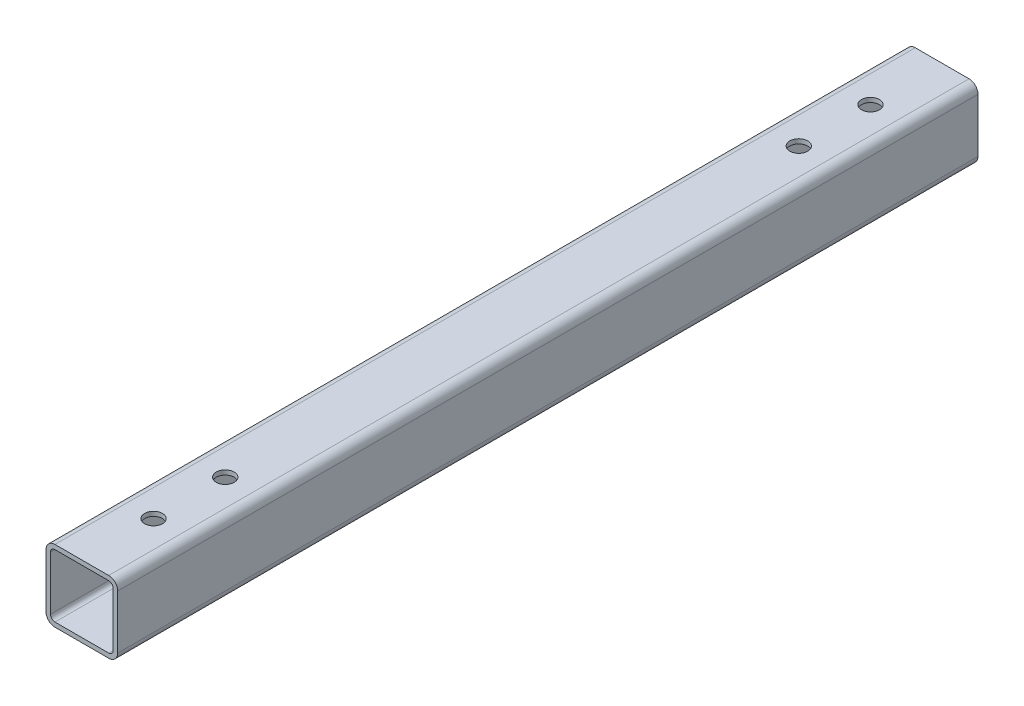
ISO-10303-21;
HEADER;
FILE_DESCRIPTION(('STEP AP214'),'2;1');
FILE_NAME('part.step','',(''),(''),'','','');
FILE_SCHEMA(('AUTOMOTIVE_DESIGN { 1 0 10303 214 1 1 1 1 }'));
ENDSEC;
DATA;
#1=APPLICATION_CONTEXT('core data for automotive mechanical design processes');
#2=APPLICATION_PROTOCOL_DEFINITION('international standard','automotive_design',2000,#1);
#3=PRODUCT_CONTEXT('',#1,'mechanical');
#4=PRODUCT('Part','Part','',(#3));
#5=PRODUCT_RELATED_PRODUCT_CATEGORY('part','',(#4));
#6=PRODUCT_DEFINITION_FORMATION('','',#4);
#7=PRODUCT_DEFINITION_CONTEXT('part definition',#1,'design');
#8=PRODUCT_DEFINITION('design','',#6,#7);
#9=PRODUCT_DEFINITION_SHAPE('','',#8);
#10=(LENGTH_UNIT() NAMED_UNIT(*) SI_UNIT(.MILLI.,.METRE.));
#11=(NAMED_UNIT(*) PLANE_ANGLE_UNIT() SI_UNIT($,.RADIAN.));
#12=(NAMED_UNIT(*) SI_UNIT($,.STERADIAN.) SOLID_ANGLE_UNIT());
#13=UNCERTAINTY_MEASURE_WITH_UNIT(LENGTH_MEASURE(1.E-05),#10,'distance_accuracy_value','');
#14=(GEOMETRIC_REPRESENTATION_CONTEXT(3) GLOBAL_UNCERTAINTY_ASSIGNED_CONTEXT((#13)) GLOBAL_UNIT_ASSIGNED_CONTEXT((#10,
#11,#12)) REPRESENTATION_CONTEXT('',''));
#15=CARTESIAN_POINT('',(0.,0.,0.));
#16=DIRECTION('',(0.,0.,1.));
#17=DIRECTION('',(1.,0.,0.));
#18=AXIS2_PLACEMENT_3D('',#15,#16,#17);
#19=CARTESIAN_POINT('',(-12.7,-12.7,-152.4));
#20=DIRECTION('',(0.,0.,-1.));
#21=DIRECTION('',(-1.,0.,0.));
#22=AXIS2_PLACEMENT_3D('',#19,#20,#21);
#23=PLANE('',#22);
#24=DIRECTION('',(0.,-1.,0.));
#25=VECTOR('',#24,1.);
#26=CARTESIAN_POINT('',(-12.7,12.7,-152.4));
#27=LINE('',#26,#25);
#28=CARTESIAN_POINT('',(-12.7,9.525,-152.4));
#29=VERTEX_POINT('',#28);
#30=CARTESIAN_POINT('',(-12.7,-9.525,-152.4));
#31=VERTEX_POINT('',#30);
#32=EDGE_CURVE('E237',#29,#31,#27,.T.);
#33=ORIENTED_EDGE('',*,*,#32,.F.);
#34=CARTESIAN_POINT('',(-9.525,9.525,-152.4));
#35=DIRECTION('',(0.,0.,-1.));
#36=DIRECTION('',(-1.,0.,0.));
#37=AXIS2_PLACEMENT_3D('',#34,#35,#36);
#38=CIRCLE('',#37,3.175);
#39=CARTESIAN_POINT('',(-9.525,12.7,-152.4));
#40=VERTEX_POINT('',#39);
#41=EDGE_CURVE('E261',#29,#40,#38,.T.);
#42=ORIENTED_EDGE('',*,*,#41,.T.);
#43=DIRECTION('',(1.,0.,0.));
#44=VECTOR('',#43,1.);
#45=CARTESIAN_POINT('',(-12.7,12.7,-152.4));
#46=LINE('',#45,#44);
#47=CARTESIAN_POINT('',(9.525,12.7,-152.4));
#48=VERTEX_POINT('',#47);
#49=EDGE_CURVE('E228',#40,#48,#46,.T.);
#50=ORIENTED_EDGE('',*,*,#49,.T.);
#51=CARTESIAN_POINT('',(9.525,9.525,-152.4));
#52=DIRECTION('',(0.,0.,-1.));
#53=DIRECTION('',(-1.,0.,0.));
#54=AXIS2_PLACEMENT_3D('',#51,#52,#53);
#55=CIRCLE('',#54,3.175);
#56=CARTESIAN_POINT('',(12.7,9.525,-152.4));
#57=VERTEX_POINT('',#56);
#58=EDGE_CURVE('E263',#48,#57,#55,.T.);
#59=ORIENTED_EDGE('',*,*,#58,.T.);
#60=DIRECTION('',(0.,1.,0.));
#61=VECTOR('',#60,1.);
#62=CARTESIAN_POINT('',(12.7,-12.7,-152.4));
#63=LINE('',#62,#61);
#64=CARTESIAN_POINT('',(12.7,-9.525,-152.4));
#65=VERTEX_POINT('',#64);
#66=EDGE_CURVE('E250',#65,#57,#63,.T.);
#67=ORIENTED_EDGE('',*,*,#66,.F.);
#68=CARTESIAN_POINT('',(9.525,-9.525,-152.4));
#69=DIRECTION('',(0.,0.,-1.));
#70=DIRECTION('',(-1.,0.,0.));
#71=AXIS2_PLACEMENT_3D('',#68,#69,#70);
#72=CIRCLE('',#71,3.175);
#73=CARTESIAN_POINT('',(9.525,-12.7,-152.4));
#74=VERTEX_POINT('',#73);
#75=EDGE_CURVE('E256',#65,#74,#72,.T.);
#76=ORIENTED_EDGE('',*,*,#75,.T.);
#77=DIRECTION('',(-1.,0.,0.));
#78=VECTOR('',#77,1.);
#79=CARTESIAN_POINT('',(12.7,-12.7,-152.4));
#80=LINE('',#79,#78);
#81=CARTESIAN_POINT('',(-9.52499999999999,-12.7,-152.4));
#82=VERTEX_POINT('',#81);
#83=EDGE_CURVE('E243',#74,#82,#80,.T.);
#84=ORIENTED_EDGE('',*,*,#83,.T.);
#85=CARTESIAN_POINT('',(-9.52499999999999,-9.525,-152.4));
#86=DIRECTION('',(0.,0.,-1.));
#87=DIRECTION('',(-1.,0.,0.));
#88=AXIS2_PLACEMENT_3D('',#85,#86,#87);
#89=CIRCLE('',#88,3.175);
#90=EDGE_CURVE('E262',#82,#31,#89,.T.);
#91=ORIENTED_EDGE('',*,*,#90,.T.);
#92=EDGE_LOOP('',(#33,#42,#50,#59,#67,#76,#84,#91));
#93=FACE_BOUND('',#92,.T.);
#94=CARTESIAN_POINT('',(-9.525,9.525,-152.4));
#95=DIRECTION('',(0.,0.,-1.));
#96=DIRECTION('',(-1.,0.,0.));
#97=AXIS2_PLACEMENT_3D('',#94,#95,#96);
#98=CIRCLE('',#97,1.5875);
#99=CARTESIAN_POINT('',(-11.1125,9.525,-152.4));
#100=VERTEX_POINT('',#99);
#101=CARTESIAN_POINT('',(-9.525,11.1125,-152.4));
#102=VERTEX_POINT('',#101);
#103=EDGE_CURVE('E210',#100,#102,#98,.T.);
#104=ORIENTED_EDGE('',*,*,#103,.F.);
#105=DIRECTION('',(0.,-1.,0.));
#106=VECTOR('',#105,1.);
#107=CARTESIAN_POINT('',(-11.1125,-12.7,-152.4));
#108=LINE('',#107,#106);
#109=CARTESIAN_POINT('',(-11.1125,-9.525,-152.4));
#110=VERTEX_POINT('',#109);
#111=EDGE_CURVE('E204',#100,#110,#108,.T.);
#112=ORIENTED_EDGE('',*,*,#111,.T.);
#113=CARTESIAN_POINT('',(-9.52499999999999,-9.525,-152.4));
#114=DIRECTION('',(0.,0.,-1.));
#115=DIRECTION('',(-1.,0.,0.));
#116=AXIS2_PLACEMENT_3D('',#113,#114,#115);
#117=CIRCLE('',#116,1.5875);
#118=CARTESIAN_POINT('',(-9.52499999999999,-11.1125,-152.4));
#119=VERTEX_POINT('',#118);
#120=EDGE_CURVE('E164',#119,#110,#117,.T.);
#121=ORIENTED_EDGE('',*,*,#120,.F.);
#122=DIRECTION('',(-1.,0.,0.));
#123=VECTOR('',#122,1.);
#124=CARTESIAN_POINT('',(-12.7,-11.1125,-152.4));
#125=LINE('',#124,#123);
#126=CARTESIAN_POINT('',(9.525,-11.1125,-152.4));
#127=VERTEX_POINT('',#126);
#128=EDGE_CURVE('E69',#127,#119,#125,.T.);
#129=ORIENTED_EDGE('',*,*,#128,.F.);
#130=CARTESIAN_POINT('',(9.525,-9.525,-152.4));
#131=DIRECTION('',(0.,0.,-1.));
#132=DIRECTION('',(-1.,0.,0.));
#133=AXIS2_PLACEMENT_3D('',#130,#131,#132);
#134=CIRCLE('',#133,1.5875);
#135=CARTESIAN_POINT('',(11.1125,-9.525,-152.4));
#136=VERTEX_POINT('',#135);
#137=EDGE_CURVE('E213',#136,#127,#134,.T.);
#138=ORIENTED_EDGE('',*,*,#137,.F.);
#139=DIRECTION('',(0.,1.,0.));
#140=VECTOR('',#139,1.);
#141=CARTESIAN_POINT('',(11.1125,-12.7,-152.4));
#142=LINE('',#141,#140);
#143=CARTESIAN_POINT('',(11.1125,9.52499999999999,-152.4));
#144=VERTEX_POINT('',#143);
#145=EDGE_CURVE('E215',#136,#144,#142,.T.);
#146=ORIENTED_EDGE('',*,*,#145,.T.);
#147=CARTESIAN_POINT('',(9.525,9.525,-152.4));
#148=DIRECTION('',(0.,0.,-1.));
#149=DIRECTION('',(-1.,0.,0.));
#150=AXIS2_PLACEMENT_3D('',#147,#148,#149);
#151=CIRCLE('',#150,1.5875);
#152=CARTESIAN_POINT('',(9.525,11.1125,-152.4));
#153=VERTEX_POINT('',#152);
#154=EDGE_CURVE('E214',#153,#144,#151,.T.);
#155=ORIENTED_EDGE('',*,*,#154,.F.);
#156=DIRECTION('',(1.,0.,0.));
#157=VECTOR('',#156,1.);
#158=CARTESIAN_POINT('',(-12.7,11.1125,-152.4));
#159=LINE('',#158,#157);
#160=EDGE_CURVE('E179',#102,#153,#159,.T.);
#161=ORIENTED_EDGE('',*,*,#160,.F.);
#162=EDGE_LOOP('',(#104,#112,#121,#129,#138,#146,#155,#161));
#163=FACE_BOUND('',#162,.T.);
#164=ADVANCED_FACE('F41',(#93,#163),#23,.T.);
#165=CARTESIAN_POINT('',(-12.7,12.7,152.4));
#166=DIRECTION('',(1.,0.,0.));
#167=DIRECTION('',(0.,1.,0.));
#168=AXIS2_PLACEMENT_3D('',#165,#166,#167);
#169=PLANE('',#168);
#170=DIRECTION('',(0.,-1.,0.));
#171=VECTOR('',#170,1.);
#172=CARTESIAN_POINT('',(-12.7,12.7,152.4));
#173=LINE('',#172,#171);
#174=CARTESIAN_POINT('',(-12.7,9.525,152.4));
#175=VERTEX_POINT('',#174);
#176=CARTESIAN_POINT('',(-12.7,-9.525,152.4));
#177=VERTEX_POINT('',#176);
#178=EDGE_CURVE('E225',#175,#177,#173,.T.);
#179=ORIENTED_EDGE('',*,*,#178,.F.);
#180=DIRECTION('',(0.,0.,-1.));
#181=VECTOR('',#180,1.);
#182=CARTESIAN_POINT('',(-12.7,9.525,-152.4));
#183=LINE('',#182,#181);
#184=EDGE_CURVE('E253',#175,#29,#183,.T.);
#185=ORIENTED_EDGE('',*,*,#184,.T.);
#186=ORIENTED_EDGE('',*,*,#32,.T.);
#187=DIRECTION('',(0.,0.,-1.));
#188=VECTOR('',#187,1.);
#189=CARTESIAN_POINT('',(-12.7,-9.525,152.4));
#190=LINE('',#189,#188);
#191=EDGE_CURVE('E238',#31,#177,#190,.F.);
#192=ORIENTED_EDGE('',*,*,#191,.T.);
#193=EDGE_LOOP('',(#179,#185,#186,#192));
#194=FACE_BOUND('',#193,.T.);
#195=ADVANCED_FACE('F384',(#194),#169,.F.);
#196=CARTESIAN_POINT('',(12.7,-12.7,152.4));
#197=DIRECTION('',(0.,-1.,0.));
#198=DIRECTION('',(1.,0.,0.));
#199=AXIS2_PLACEMENT_3D('',#196,#197,#198);
#200=PLANE('',#199);
#201=CARTESIAN_POINT('',(0.,-12.7,-101.6));
#202=DIRECTION('',(0.,-1.,0.));
#203=DIRECTION('',(1.,0.,0.));
#204=AXIS2_PLACEMENT_3D('',#201,#202,#203);
#205=CIRCLE('',#204,3.17499999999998);
#206=CARTESIAN_POINT('',(3.17499999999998,-12.7,-101.6));
#207=VERTEX_POINT('',#206);
#208=EDGE_CURVE('E581',#207,#207,#205,.T.);
#209=ORIENTED_EDGE('',*,*,#208,.F.);
#210=EDGE_LOOP('',(#209));
#211=FACE_BOUND('',#210,.T.);
#212=CARTESIAN_POINT('',(0.,-12.7,-127.));
#213=DIRECTION('',(0.,-1.,0.));
#214=DIRECTION('',(1.,0.,0.));
#215=AXIS2_PLACEMENT_3D('',#212,#213,#214);
#216=CIRCLE('',#215,3.17499999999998);
#217=CARTESIAN_POINT('',(3.17499999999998,-12.7,-127.));
#218=VERTEX_POINT('',#217);
#219=EDGE_CURVE('E309',#218,#218,#216,.T.);
#220=ORIENTED_EDGE('',*,*,#219,.F.);
#221=EDGE_LOOP('',(#220));
#222=FACE_BOUND('',#221,.T.);
#223=CARTESIAN_POINT('',(0.,-12.7,101.6));
#224=DIRECTION('',(0.,-1.,0.));
#225=DIRECTION('',(1.,0.,0.));
#226=AXIS2_PLACEMENT_3D('',#223,#224,#225);
#227=CIRCLE('',#226,3.17499999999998);
#228=CARTESIAN_POINT('',(3.17499999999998,-12.7,101.6));
#229=VERTEX_POINT('',#228);
#230=EDGE_CURVE('E310',#229,#229,#227,.T.);
#231=ORIENTED_EDGE('',*,*,#230,.F.);
#232=EDGE_LOOP('',(#231));
#233=FACE_BOUND('',#232,.T.);
#234=CARTESIAN_POINT('',(0.,-12.7,127.));
#235=DIRECTION('',(0.,-1.,0.));
#236=DIRECTION('',(1.,0.,0.));
#237=AXIS2_PLACEMENT_3D('',#234,#235,#236);
#238=CIRCLE('',#237,3.17499999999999);
#239=CARTESIAN_POINT('',(3.17499999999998,-12.7,127.));
#240=VERTEX_POINT('',#239);
#241=EDGE_CURVE('E328',#240,#240,#238,.T.);
#242=ORIENTED_EDGE('',*,*,#241,.F.);
#243=EDGE_LOOP('',(#242));
#244=FACE_BOUND('',#243,.T.);
#245=DIRECTION('',(-1.,0.,0.));
#246=VECTOR('',#245,1.);
#247=CARTESIAN_POINT('',(12.7,-12.7,152.4));
#248=LINE('',#247,#246);
#249=CARTESIAN_POINT('',(9.525,-12.7,152.4));
#250=VERTEX_POINT('',#249);
#251=CARTESIAN_POINT('',(-9.52499999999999,-12.7,152.4));
#252=VERTEX_POINT('',#251);
#253=EDGE_CURVE('E224',#250,#252,#248,.T.);
#254=ORIENTED_EDGE('',*,*,#253,.T.);
#255=DIRECTION('',(0.,0.,-1.));
#256=VECTOR('',#255,1.);
#257=CARTESIAN_POINT('',(-9.52499999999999,-12.7,-152.4));
#258=LINE('',#257,#256);
#259=EDGE_CURVE('E284',#252,#82,#258,.T.);
#260=ORIENTED_EDGE('',*,*,#259,.T.);
#261=ORIENTED_EDGE('',*,*,#83,.F.);
#262=DIRECTION('',(0.,0.,-1.));
#263=VECTOR('',#262,1.);
#264=CARTESIAN_POINT('',(9.525,-12.7,152.4));
#265=LINE('',#264,#263);
#266=EDGE_CURVE('E285',#74,#250,#265,.F.);
#267=ORIENTED_EDGE('',*,*,#266,.T.);
#268=EDGE_LOOP('',(#254,#260,#261,#267));
#269=FACE_BOUND('',#268,.T.);
#270=ADVANCED_FACE('F386',(#211,#222,#233,#244,#269),#200,.T.);
#271=CARTESIAN_POINT('',(12.7,-12.7,152.4));
#272=DIRECTION('',(-1.,0.,0.));
#273=DIRECTION('',(0.,0.,1.));
#274=AXIS2_PLACEMENT_3D('',#271,#272,#273);
#275=PLANE('',#274);
#276=ORIENTED_EDGE('',*,*,#66,.T.);
#277=DIRECTION('',(0.,0.,-1.));
#278=VECTOR('',#277,1.);
#279=CARTESIAN_POINT('',(12.7,9.525,152.4));
#280=LINE('',#279,#278);
#281=CARTESIAN_POINT('',(12.7,9.525,152.4));
#282=VERTEX_POINT('',#281);
#283=EDGE_CURVE('E11',#57,#282,#280,.F.);
#284=ORIENTED_EDGE('',*,*,#283,.T.);
#285=DIRECTION('',(0.,1.,0.));
#286=VECTOR('',#285,1.);
#287=CARTESIAN_POINT('',(12.7,-12.7,152.4));
#288=LINE('',#287,#286);
#289=CARTESIAN_POINT('',(12.7,-9.525,152.4));
#290=VERTEX_POINT('',#289);
#291=EDGE_CURVE('E229',#290,#282,#288,.T.);
#292=ORIENTED_EDGE('',*,*,#291,.F.);
#293=DIRECTION('',(0.,0.,-1.));
#294=VECTOR('',#293,1.);
#295=CARTESIAN_POINT('',(12.7,-9.525,-152.4));
#296=LINE('',#295,#294);
#297=EDGE_CURVE('E51',#290,#65,#296,.T.);
#298=ORIENTED_EDGE('',*,*,#297,.T.);
#299=EDGE_LOOP('',(#276,#284,#292,#298));
#300=FACE_BOUND('',#299,.T.);
#301=ADVANCED_FACE('F396',(#300),#275,.F.);
#302=CARTESIAN_POINT('',(-12.7,12.7,152.4));
#303=DIRECTION('',(0.,1.,0.));
#304=DIRECTION('',(-1.,0.,0.));
#305=AXIS2_PLACEMENT_3D('',#302,#303,#304);
#306=PLANE('',#305);
#307=CARTESIAN_POINT('',(0.,12.7,-101.6));
#308=DIRECTION('',(0.,-1.,0.));
#309=DIRECTION('',(1.,0.,0.));
#310=AXIS2_PLACEMENT_3D('',#307,#308,#309);
#311=CIRCLE('',#310,3.17499999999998);
#312=CARTESIAN_POINT('',(3.17499999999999,12.7,-101.6));
#313=VERTEX_POINT('',#312);
#314=EDGE_CURVE('E589',#313,#313,#311,.T.);
#315=ORIENTED_EDGE('',*,*,#314,.T.);
#316=EDGE_LOOP('',(#315));
#317=FACE_BOUND('',#316,.T.);
#318=CARTESIAN_POINT('',(0.,12.7,-127.));
#319=DIRECTION('',(0.,-1.,0.));
#320=DIRECTION('',(1.,0.,0.));
#321=AXIS2_PLACEMENT_3D('',#318,#319,#320);
#322=CIRCLE('',#321,3.17499999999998);
#323=CARTESIAN_POINT('',(3.17499999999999,12.7,-127.));
#324=VERTEX_POINT('',#323);
#325=EDGE_CURVE('E303',#324,#324,#322,.T.);
#326=ORIENTED_EDGE('',*,*,#325,.T.);
#327=EDGE_LOOP('',(#326));
#328=FACE_BOUND('',#327,.T.);
#329=CARTESIAN_POINT('',(0.,12.7,101.6));
#330=DIRECTION('',(0.,-1.,0.));
#331=DIRECTION('',(1.,0.,0.));
#332=AXIS2_PLACEMENT_3D('',#329,#330,#331);
#333=CIRCLE('',#332,3.17499999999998);
#334=CARTESIAN_POINT('',(3.17499999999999,12.7,101.6));
#335=VERTEX_POINT('',#334);
#336=EDGE_CURVE('E299',#335,#335,#333,.T.);
#337=ORIENTED_EDGE('',*,*,#336,.T.);
#338=EDGE_LOOP('',(#337));
#339=FACE_BOUND('',#338,.T.);
#340=CARTESIAN_POINT('',(0.,12.7,127.));
#341=DIRECTION('',(0.,-1.,0.));
#342=DIRECTION('',(1.,0.,0.));
#343=AXIS2_PLACEMENT_3D('',#340,#341,#342);
#344=CIRCLE('',#343,3.17499999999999);
#345=CARTESIAN_POINT('',(3.17499999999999,12.7,127.));
#346=VERTEX_POINT('',#345);
#347=EDGE_CURVE('E294',#346,#346,#344,.T.);
#348=ORIENTED_EDGE('',*,*,#347,.T.);
#349=EDGE_LOOP('',(#348));
#350=FACE_BOUND('',#349,.T.);
#351=ORIENTED_EDGE('',*,*,#49,.F.);
#352=DIRECTION('',(0.,0.,-1.));
#353=VECTOR('',#352,1.);
#354=CARTESIAN_POINT('',(-9.525,12.7,152.4));
#355=LINE('',#354,#353);
#356=CARTESIAN_POINT('',(-9.525,12.7,152.4));
#357=VERTEX_POINT('',#356);
#358=EDGE_CURVE('E272',#40,#357,#355,.F.);
#359=ORIENTED_EDGE('',*,*,#358,.T.);
#360=DIRECTION('',(1.,0.,0.));
#361=VECTOR('',#360,1.);
#362=CARTESIAN_POINT('',(-12.7,12.7,152.4));
#363=LINE('',#362,#361);
#364=CARTESIAN_POINT('',(9.525,12.7,152.4));
#365=VERTEX_POINT('',#364);
#366=EDGE_CURVE('E234',#357,#365,#363,.T.);
#367=ORIENTED_EDGE('',*,*,#366,.T.);
#368=DIRECTION('',(0.,0.,-1.));
#369=VECTOR('',#368,1.);
#370=CARTESIAN_POINT('',(9.525,12.7,-152.4));
#371=LINE('',#370,#369);
#372=EDGE_CURVE('E270',#365,#48,#371,.T.);
#373=ORIENTED_EDGE('',*,*,#372,.T.);
#374=EDGE_LOOP('',(#351,#359,#367,#373));
#375=FACE_BOUND('',#374,.T.);
#376=ADVANCED_FACE('F398',(#317,#328,#339,#350,#375),#306,.T.);
#377=CARTESIAN_POINT('',(-12.7,-12.7,152.4));
#378=DIRECTION('',(0.,0.,-1.));
#379=DIRECTION('',(-1.,0.,0.));
#380=AXIS2_PLACEMENT_3D('',#377,#378,#379);
#381=PLANE('',#380);
#382=CARTESIAN_POINT('',(-9.525,9.525,152.4));
#383=DIRECTION('',(0.,0.,-1.));
#384=DIRECTION('',(-1.,0.,0.));
#385=AXIS2_PLACEMENT_3D('',#382,#383,#384);
#386=CIRCLE('',#385,1.5875);
#387=CARTESIAN_POINT('',(-9.525,11.1125,152.4));
#388=VERTEX_POINT('',#387);
#389=CARTESIAN_POINT('',(-11.1125,9.525,152.4));
#390=VERTEX_POINT('',#389);
#391=EDGE_CURVE('E190',#388,#390,#386,.F.);
#392=ORIENTED_EDGE('',*,*,#391,.F.);
#393=DIRECTION('',(1.,0.,0.));
#394=VECTOR('',#393,1.);
#395=CARTESIAN_POINT('',(-12.7,11.1125,152.4));
#396=LINE('',#395,#394);
#397=CARTESIAN_POINT('',(9.525,11.1125,152.4));
#398=VERTEX_POINT('',#397);
#399=EDGE_CURVE('E171',#388,#398,#396,.T.);
#400=ORIENTED_EDGE('',*,*,#399,.T.);
#401=CARTESIAN_POINT('',(9.525,9.525,152.4));
#402=DIRECTION('',(0.,0.,-1.));
#403=DIRECTION('',(-1.,0.,0.));
#404=AXIS2_PLACEMENT_3D('',#401,#402,#403);
#405=CIRCLE('',#404,1.5875);
#406=CARTESIAN_POINT('',(11.1125,9.52499999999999,152.4));
#407=VERTEX_POINT('',#406);
#408=EDGE_CURVE('E189',#407,#398,#405,.F.);
#409=ORIENTED_EDGE('',*,*,#408,.F.);
#410=DIRECTION('',(0.,1.,0.));
#411=VECTOR('',#410,1.);
#412=CARTESIAN_POINT('',(11.1125,-12.7,152.4));
#413=LINE('',#412,#411);
#414=CARTESIAN_POINT('',(11.1125,-9.525,152.4));
#415=VERTEX_POINT('',#414);
#416=EDGE_CURVE('E56',#415,#407,#413,.T.);
#417=ORIENTED_EDGE('',*,*,#416,.F.);
#418=CARTESIAN_POINT('',(9.525,-9.525,152.4));
#419=DIRECTION('',(0.,0.,-1.));
#420=DIRECTION('',(-1.,0.,0.));
#421=AXIS2_PLACEMENT_3D('',#418,#419,#420);
#422=CIRCLE('',#421,1.5875);
#423=CARTESIAN_POINT('',(9.525,-11.1125,152.4));
#424=VERTEX_POINT('',#423);
#425=EDGE_CURVE('E195',#424,#415,#422,.F.);
#426=ORIENTED_EDGE('',*,*,#425,.F.);
#427=DIRECTION('',(-1.,0.,0.));
#428=VECTOR('',#427,1.);
#429=CARTESIAN_POINT('',(-12.7,-11.1125,152.4));
#430=LINE('',#429,#428);
#431=CARTESIAN_POINT('',(-9.52499999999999,-11.1125,152.4));
#432=VERTEX_POINT('',#431);
#433=EDGE_CURVE('E177',#424,#432,#430,.T.);
#434=ORIENTED_EDGE('',*,*,#433,.T.);
#435=CARTESIAN_POINT('',(-9.52499999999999,-9.525,152.4));
#436=DIRECTION('',(0.,0.,-1.));
#437=DIRECTION('',(-1.,0.,0.));
#438=AXIS2_PLACEMENT_3D('',#435,#436,#437);
#439=CIRCLE('',#438,1.5875);
#440=CARTESIAN_POINT('',(-11.1125,-9.525,152.4));
#441=VERTEX_POINT('',#440);
#442=EDGE_CURVE('E161',#441,#432,#439,.F.);
#443=ORIENTED_EDGE('',*,*,#442,.F.);
#444=DIRECTION('',(0.,-1.,0.));
#445=VECTOR('',#444,1.);
#446=CARTESIAN_POINT('',(-11.1125,-12.7,152.4));
#447=LINE('',#446,#445);
#448=EDGE_CURVE('E174',#390,#441,#447,.T.);
#449=ORIENTED_EDGE('',*,*,#448,.F.);
#450=EDGE_LOOP('',(#392,#400,#409,#417,#426,#434,#443,#449));
#451=FACE_BOUND('',#450,.T.);
#452=ORIENTED_EDGE('',*,*,#366,.F.);
#453=CARTESIAN_POINT('',(-9.525,9.525,152.4));
#454=DIRECTION('',(0.,0.,-1.));
#455=DIRECTION('',(-1.,0.,0.));
#456=AXIS2_PLACEMENT_3D('',#453,#454,#455);
#457=CIRCLE('',#456,3.175);
#458=EDGE_CURVE('E278',#357,#175,#457,.F.);
#459=ORIENTED_EDGE('',*,*,#458,.T.);
#460=ORIENTED_EDGE('',*,*,#178,.T.);
#461=CARTESIAN_POINT('',(-9.52499999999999,-9.525,152.4));
#462=DIRECTION('',(0.,0.,-1.));
#463=DIRECTION('',(-1.,0.,0.));
#464=AXIS2_PLACEMENT_3D('',#461,#462,#463);
#465=CIRCLE('',#464,3.175);
#466=EDGE_CURVE('E279',#177,#252,#465,.F.);
#467=ORIENTED_EDGE('',*,*,#466,.T.);
#468=ORIENTED_EDGE('',*,*,#253,.F.);
#469=CARTESIAN_POINT('',(9.525,-9.525,152.4));
#470=DIRECTION('',(0.,0.,-1.));
#471=DIRECTION('',(-1.,0.,0.));
#472=AXIS2_PLACEMENT_3D('',#469,#470,#471);
#473=CIRCLE('',#472,3.175);
#474=EDGE_CURVE('E274',#250,#290,#473,.F.);
#475=ORIENTED_EDGE('',*,*,#474,.T.);
#476=ORIENTED_EDGE('',*,*,#291,.T.);
#477=CARTESIAN_POINT('',(9.525,9.525,152.4));
#478=DIRECTION('',(0.,0.,-1.));
#479=DIRECTION('',(-1.,0.,0.));
#480=AXIS2_PLACEMENT_3D('',#477,#478,#479);
#481=CIRCLE('',#480,3.175);
#482=EDGE_CURVE('E277',#282,#365,#481,.F.);
#483=ORIENTED_EDGE('',*,*,#482,.T.);
#484=EDGE_LOOP('',(#452,#459,#460,#467,#468,#475,#476,#483));
#485=FACE_BOUND('',#484,.T.);
#486=ADVANCED_FACE('F182',(#451,#485),#381,.F.);
#487=CARTESIAN_POINT('',(-9.525,9.525,152.4));
#488=DIRECTION('',(0.,0.,1.));
#489=DIRECTION('',(1.,0.,0.));
#490=AXIS2_PLACEMENT_3D('',#487,#488,#489);
#491=CYLINDRICAL_SURFACE('',#490,3.175);
#492=ORIENTED_EDGE('',*,*,#458,.F.);
#493=ORIENTED_EDGE('',*,*,#358,.F.);
#494=ORIENTED_EDGE('',*,*,#41,.F.);
#495=ORIENTED_EDGE('',*,*,#184,.F.);
#496=EDGE_LOOP('',(#492,#493,#494,#495));
#497=FACE_BOUND('',#496,.T.);
#498=ADVANCED_FACE('F407',(#497),#491,.T.);
#499=CARTESIAN_POINT('',(-9.52499999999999,-9.525,152.4));
#500=DIRECTION('',(0.,0.,1.));
#501=DIRECTION('',(1.,0.,0.));
#502=AXIS2_PLACEMENT_3D('',#499,#500,#501);
#503=CYLINDRICAL_SURFACE('',#502,3.175);
#504=ORIENTED_EDGE('',*,*,#466,.F.);
#505=ORIENTED_EDGE('',*,*,#191,.F.);
#506=ORIENTED_EDGE('',*,*,#90,.F.);
#507=ORIENTED_EDGE('',*,*,#259,.F.);
#508=EDGE_LOOP('',(#504,#505,#506,#507));
#509=FACE_BOUND('',#508,.T.);
#510=ADVANCED_FACE('F406',(#509),#503,.T.);
#511=CARTESIAN_POINT('',(9.525,9.525,152.4));
#512=DIRECTION('',(0.,0.,1.));
#513=DIRECTION('',(1.,0.,0.));
#514=AXIS2_PLACEMENT_3D('',#511,#512,#513);
#515=CYLINDRICAL_SURFACE('',#514,3.175);
#516=ORIENTED_EDGE('',*,*,#482,.F.);
#517=ORIENTED_EDGE('',*,*,#283,.F.);
#518=ORIENTED_EDGE('',*,*,#58,.F.);
#519=ORIENTED_EDGE('',*,*,#372,.F.);
#520=EDGE_LOOP('',(#516,#517,#518,#519));
#521=FACE_BOUND('',#520,.T.);
#522=ADVANCED_FACE('F415',(#521),#515,.T.);
#523=CARTESIAN_POINT('',(9.525,-9.525,152.4));
#524=DIRECTION('',(0.,0.,1.));
#525=DIRECTION('',(1.,0.,0.));
#526=AXIS2_PLACEMENT_3D('',#523,#524,#525);
#527=CYLINDRICAL_SURFACE('',#526,3.175);
#528=ORIENTED_EDGE('',*,*,#474,.F.);
#529=ORIENTED_EDGE('',*,*,#266,.F.);
#530=ORIENTED_EDGE('',*,*,#75,.F.);
#531=ORIENTED_EDGE('',*,*,#297,.F.);
#532=EDGE_LOOP('',(#528,#529,#530,#531));
#533=FACE_BOUND('',#532,.T.);
#534=ADVANCED_FACE('F43',(#533),#527,.T.);
#535=CARTESIAN_POINT('',(-11.1125,12.7,152.4));
#536=DIRECTION('',(1.,0.,0.));
#537=DIRECTION('',(0.,1.,0.));
#538=AXIS2_PLACEMENT_3D('',#535,#536,#537);
#539=PLANE('',#538);
#540=ORIENTED_EDGE('',*,*,#448,.T.);
#541=DIRECTION('',(0.,0.,1.));
#542=VECTOR('',#541,1.);
#543=CARTESIAN_POINT('',(-11.1125,-9.525,152.4));
#544=LINE('',#543,#542);
#545=EDGE_CURVE('E158',#110,#441,#544,.T.);
#546=ORIENTED_EDGE('',*,*,#545,.F.);
#547=ORIENTED_EDGE('',*,*,#111,.F.);
#548=DIRECTION('',(0.,0.,1.));
#549=VECTOR('',#548,1.);
#550=CARTESIAN_POINT('',(-11.1125,9.525,152.4));
#551=LINE('',#550,#549);
#552=EDGE_CURVE('E167',#390,#100,#551,.F.);
#553=ORIENTED_EDGE('',*,*,#552,.F.);
#554=EDGE_LOOP('',(#540,#546,#547,#553));
#555=FACE_BOUND('',#554,.T.);
#556=ADVANCED_FACE('F176',(#555),#539,.T.);
#557=CARTESIAN_POINT('',(12.7,-11.1125,152.4));
#558=DIRECTION('',(0.,-1.,0.));
#559=DIRECTION('',(1.,0.,0.));
#560=AXIS2_PLACEMENT_3D('',#557,#558,#559);
#561=PLANE('',#560);
#562=CARTESIAN_POINT('',(0.,-11.1125,-101.6));
#563=DIRECTION('',(0.,-1.,0.));
#564=DIRECTION('',(1.,0.,0.));
#565=AXIS2_PLACEMENT_3D('',#562,#563,#564);
#566=CIRCLE('',#565,3.17499999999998);
#567=CARTESIAN_POINT('',(3.17499999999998,-11.1125,-101.6));
#568=VERTEX_POINT('',#567);
#569=EDGE_CURVE('E314',#568,#568,#566,.T.);
#570=ORIENTED_EDGE('',*,*,#569,.T.);
#571=EDGE_LOOP('',(#570));
#572=FACE_BOUND('',#571,.T.);
#573=CARTESIAN_POINT('',(0.,-11.1125,-127.));
#574=DIRECTION('',(0.,-1.,0.));
#575=DIRECTION('',(1.,0.,0.));
#576=AXIS2_PLACEMENT_3D('',#573,#574,#575);
#577=CIRCLE('',#576,3.17499999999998);
#578=CARTESIAN_POINT('',(3.17499999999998,-11.1125,-127.));
#579=VERTEX_POINT('',#578);
#580=EDGE_CURVE('E305',#579,#579,#577,.T.);
#581=ORIENTED_EDGE('',*,*,#580,.T.);
#582=EDGE_LOOP('',(#581));
#583=FACE_BOUND('',#582,.T.);
#584=CARTESIAN_POINT('',(0.,-11.1125,101.6));
#585=DIRECTION('',(0.,-1.,0.));
#586=DIRECTION('',(1.,0.,0.));
#587=AXIS2_PLACEMENT_3D('',#584,#585,#586);
#588=CIRCLE('',#587,3.17499999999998);
#589=CARTESIAN_POINT('',(3.17499999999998,-11.1125,101.6));
#590=VERTEX_POINT('',#589);
#591=EDGE_CURVE('E296',#590,#590,#588,.T.);
#592=ORIENTED_EDGE('',*,*,#591,.T.);
#593=EDGE_LOOP('',(#592));
#594=FACE_BOUND('',#593,.T.);
#595=CARTESIAN_POINT('',(0.,-11.1125,127.));
#596=DIRECTION('',(0.,-1.,0.));
#597=DIRECTION('',(1.,0.,0.));
#598=AXIS2_PLACEMENT_3D('',#595,#596,#597);
#599=CIRCLE('',#598,3.17499999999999);
#600=CARTESIAN_POINT('',(3.17499999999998,-11.1125,127.));
#601=VERTEX_POINT('',#600);
#602=EDGE_CURVE('E207',#601,#601,#599,.T.);
#603=ORIENTED_EDGE('',*,*,#602,.T.);
#604=EDGE_LOOP('',(#603));
#605=FACE_BOUND('',#604,.T.);
#606=ORIENTED_EDGE('',*,*,#433,.F.);
#607=DIRECTION('',(0.,0.,1.));
#608=VECTOR('',#607,1.);
#609=CARTESIAN_POINT('',(9.525,-11.1125,152.4));
#610=LINE('',#609,#608);
#611=EDGE_CURVE('E188',#127,#424,#610,.T.);
#612=ORIENTED_EDGE('',*,*,#611,.F.);
#613=ORIENTED_EDGE('',*,*,#128,.T.);
#614=DIRECTION('',(0.,0.,1.));
#615=VECTOR('',#614,1.);
#616=CARTESIAN_POINT('',(-9.52499999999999,-11.1125,152.4));
#617=LINE('',#616,#615);
#618=EDGE_CURVE('E341',#432,#119,#617,.F.);
#619=ORIENTED_EDGE('',*,*,#618,.F.);
#620=EDGE_LOOP('',(#606,#612,#613,#619));
#621=FACE_BOUND('',#620,.T.);
#622=ADVANCED_FACE('F367',(#572,#583,#594,#605,#621),#561,.F.);
#623=CARTESIAN_POINT('',(11.1125,-12.7,152.4));
#624=DIRECTION('',(-1.,0.,0.));
#625=DIRECTION('',(0.,0.,1.));
#626=AXIS2_PLACEMENT_3D('',#623,#624,#625);
#627=PLANE('',#626);
#628=ORIENTED_EDGE('',*,*,#145,.F.);
#629=DIRECTION('',(0.,0.,1.));
#630=VECTOR('',#629,1.);
#631=CARTESIAN_POINT('',(11.1125,-9.525,152.4));
#632=LINE('',#631,#630);
#633=EDGE_CURVE('E342',#415,#136,#632,.F.);
#634=ORIENTED_EDGE('',*,*,#633,.F.);
#635=ORIENTED_EDGE('',*,*,#416,.T.);
#636=DIRECTION('',(0.,0.,1.));
#637=VECTOR('',#636,1.);
#638=CARTESIAN_POINT('',(11.1125,9.52499999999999,152.4));
#639=LINE('',#638,#637);
#640=EDGE_CURVE('E242',#144,#407,#639,.T.);
#641=ORIENTED_EDGE('',*,*,#640,.F.);
#642=EDGE_LOOP('',(#628,#634,#635,#641));
#643=FACE_BOUND('',#642,.T.);
#644=ADVANCED_FACE('F366',(#643),#627,.T.);
#645=CARTESIAN_POINT('',(-12.7,11.1125,152.4));
#646=DIRECTION('',(0.,1.,0.));
#647=DIRECTION('',(-1.,0.,0.));
#648=AXIS2_PLACEMENT_3D('',#645,#646,#647);
#649=PLANE('',#648);
#650=CARTESIAN_POINT('',(0.,11.1125,-101.6));
#651=DIRECTION('',(0.,1.,0.));
#652=DIRECTION('',(-1.,0.,0.));
#653=AXIS2_PLACEMENT_3D('',#650,#651,#652);
#654=CIRCLE('',#653,3.17499999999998);
#655=CARTESIAN_POINT('',(-3.17499999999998,11.1125,-101.6));
#656=VERTEX_POINT('',#655);
#657=EDGE_CURVE('E44',#656,#656,#654,.T.);
#658=ORIENTED_EDGE('',*,*,#657,.T.);
#659=EDGE_LOOP('',(#658));
#660=FACE_BOUND('',#659,.T.);
#661=CARTESIAN_POINT('',(0.,11.1125,-127.));
#662=DIRECTION('',(0.,1.,0.));
#663=DIRECTION('',(-1.,0.,0.));
#664=AXIS2_PLACEMENT_3D('',#661,#662,#663);
#665=CIRCLE('',#664,3.17499999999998);
#666=CARTESIAN_POINT('',(-3.17499999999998,11.1125,-127.));
#667=VERTEX_POINT('',#666);
#668=EDGE_CURVE('E297',#667,#667,#665,.T.);
#669=ORIENTED_EDGE('',*,*,#668,.T.);
#670=EDGE_LOOP('',(#669));
#671=FACE_BOUND('',#670,.T.);
#672=CARTESIAN_POINT('',(0.,11.1125,101.6));
#673=DIRECTION('',(0.,1.,0.));
#674=DIRECTION('',(-1.,0.,0.));
#675=AXIS2_PLACEMENT_3D('',#672,#673,#674);
#676=CIRCLE('',#675,3.17499999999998);
#677=CARTESIAN_POINT('',(-3.17499999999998,11.1125,101.6));
#678=VERTEX_POINT('',#677);
#679=EDGE_CURVE('E298',#678,#678,#676,.T.);
#680=ORIENTED_EDGE('',*,*,#679,.T.);
#681=EDGE_LOOP('',(#680));
#682=FACE_BOUND('',#681,.T.);
#683=CARTESIAN_POINT('',(0.,11.1125,127.));
#684=DIRECTION('',(0.,1.,0.));
#685=DIRECTION('',(-1.,0.,0.));
#686=AXIS2_PLACEMENT_3D('',#683,#684,#685);
#687=CIRCLE('',#686,3.17499999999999);
#688=CARTESIAN_POINT('',(-3.17499999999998,11.1125,127.));
#689=VERTEX_POINT('',#688);
#690=EDGE_CURVE('E292',#689,#689,#687,.T.);
#691=ORIENTED_EDGE('',*,*,#690,.T.);
#692=EDGE_LOOP('',(#691));
#693=FACE_BOUND('',#692,.T.);
#694=ORIENTED_EDGE('',*,*,#160,.T.);
#695=DIRECTION('',(0.,0.,1.));
#696=VECTOR('',#695,1.);
#697=CARTESIAN_POINT('',(9.525,11.1125,152.4));
#698=LINE('',#697,#696);
#699=EDGE_CURVE('E209',#398,#153,#698,.F.);
#700=ORIENTED_EDGE('',*,*,#699,.F.);
#701=ORIENTED_EDGE('',*,*,#399,.F.);
#702=DIRECTION('',(0.,0.,1.));
#703=VECTOR('',#702,1.);
#704=CARTESIAN_POINT('',(-9.525,11.1125,152.4));
#705=LINE('',#704,#703);
#706=EDGE_CURVE('E197',#102,#388,#705,.T.);
#707=ORIENTED_EDGE('',*,*,#706,.F.);
#708=EDGE_LOOP('',(#694,#700,#701,#707));
#709=FACE_BOUND('',#708,.T.);
#710=ADVANCED_FACE('F359',(#660,#671,#682,#693,#709),#649,.F.);
#711=CARTESIAN_POINT('',(-9.525,9.525,152.4));
#712=DIRECTION('',(0.,0.,1.));
#713=DIRECTION('',(1.,0.,0.));
#714=AXIS2_PLACEMENT_3D('',#711,#712,#713);
#715=CYLINDRICAL_SURFACE('',#714,1.5875);
#716=ORIENTED_EDGE('',*,*,#391,.T.);
#717=ORIENTED_EDGE('',*,*,#552,.T.);
#718=ORIENTED_EDGE('',*,*,#103,.T.);
#719=ORIENTED_EDGE('',*,*,#706,.T.);
#720=EDGE_LOOP('',(#716,#717,#718,#719));
#721=FACE_BOUND('',#720,.T.);
#722=ADVANCED_FACE('F357',(#721),#715,.F.);
#723=CARTESIAN_POINT('',(-9.52499999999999,-9.525,152.4));
#724=DIRECTION('',(0.,0.,1.));
#725=DIRECTION('',(1.,0.,0.));
#726=AXIS2_PLACEMENT_3D('',#723,#724,#725);
#727=CYLINDRICAL_SURFACE('',#726,1.5875);
#728=ORIENTED_EDGE('',*,*,#442,.T.);
#729=ORIENTED_EDGE('',*,*,#618,.T.);
#730=ORIENTED_EDGE('',*,*,#120,.T.);
#731=ORIENTED_EDGE('',*,*,#545,.T.);
#732=EDGE_LOOP('',(#728,#729,#730,#731));
#733=FACE_BOUND('',#732,.T.);
#734=ADVANCED_FACE('F163',(#733),#727,.F.);
#735=CARTESIAN_POINT('',(9.525,9.525,152.4));
#736=DIRECTION('',(0.,0.,1.));
#737=DIRECTION('',(1.,0.,0.));
#738=AXIS2_PLACEMENT_3D('',#735,#736,#737);
#739=CYLINDRICAL_SURFACE('',#738,1.5875);
#740=ORIENTED_EDGE('',*,*,#408,.T.);
#741=ORIENTED_EDGE('',*,*,#699,.T.);
#742=ORIENTED_EDGE('',*,*,#154,.T.);
#743=ORIENTED_EDGE('',*,*,#640,.T.);
#744=EDGE_LOOP('',(#740,#741,#742,#743));
#745=FACE_BOUND('',#744,.T.);
#746=ADVANCED_FACE('F364',(#745),#739,.F.);
#747=CARTESIAN_POINT('',(9.525,-9.525,152.4));
#748=DIRECTION('',(0.,0.,1.));
#749=DIRECTION('',(1.,0.,0.));
#750=AXIS2_PLACEMENT_3D('',#747,#748,#749);
#751=CYLINDRICAL_SURFACE('',#750,1.5875);
#752=ORIENTED_EDGE('',*,*,#425,.T.);
#753=ORIENTED_EDGE('',*,*,#633,.T.);
#754=ORIENTED_EDGE('',*,*,#137,.T.);
#755=ORIENTED_EDGE('',*,*,#611,.T.);
#756=EDGE_LOOP('',(#752,#753,#754,#755));
#757=FACE_BOUND('',#756,.T.);
#758=ADVANCED_FACE('F368',(#757),#751,.F.);
#759=CARTESIAN_POINT('',(0.,12.7,127.));
#760=DIRECTION('',(0.,-1.,0.));
#761=DIRECTION('',(1.,0.,0.));
#762=AXIS2_PLACEMENT_3D('',#759,#760,#761);
#763=CYLINDRICAL_SURFACE('',#762,3.17499999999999);
#764=ORIENTED_EDGE('',*,*,#347,.F.);
#765=EDGE_LOOP('',(#764));
#766=FACE_BOUND('',#765,.T.);
#767=ORIENTED_EDGE('',*,*,#690,.F.);
#768=EDGE_LOOP('',(#767));
#769=FACE_BOUND('',#768,.T.);
#770=ADVANCED_FACE('F523',(#766,#769),#763,.F.);
#771=ORIENTED_EDGE('',*,*,#241,.T.);
#772=EDGE_LOOP('',(#771));
#773=FACE_BOUND('',#772,.T.);
#774=ORIENTED_EDGE('',*,*,#602,.F.);
#775=EDGE_LOOP('',(#774));
#776=FACE_BOUND('',#775,.T.);
#777=ADVANCED_FACE('F530',(#773,#776),#763,.F.);
#778=CARTESIAN_POINT('',(0.,12.7,101.6));
#779=DIRECTION('',(0.,-1.,0.));
#780=DIRECTION('',(1.,0.,0.));
#781=AXIS2_PLACEMENT_3D('',#778,#779,#780);
#782=CYLINDRICAL_SURFACE('',#781,3.17499999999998);
#783=ORIENTED_EDGE('',*,*,#336,.F.);
#784=EDGE_LOOP('',(#783));
#785=FACE_BOUND('',#784,.T.);
#786=ORIENTED_EDGE('',*,*,#679,.F.);
#787=EDGE_LOOP('',(#786));
#788=FACE_BOUND('',#787,.T.);
#789=ADVANCED_FACE('F533',(#785,#788),#782,.F.);
#790=ORIENTED_EDGE('',*,*,#230,.T.);
#791=EDGE_LOOP('',(#790));
#792=FACE_BOUND('',#791,.T.);
#793=ORIENTED_EDGE('',*,*,#591,.F.);
#794=EDGE_LOOP('',(#793));
#795=FACE_BOUND('',#794,.T.);
#796=ADVANCED_FACE('F545',(#792,#795),#782,.F.);
#797=CARTESIAN_POINT('',(0.,12.7,-127.));
#798=DIRECTION('',(0.,-1.,0.));
#799=DIRECTION('',(1.,0.,0.));
#800=AXIS2_PLACEMENT_3D('',#797,#798,#799);
#801=CYLINDRICAL_SURFACE('',#800,3.17499999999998);
#802=ORIENTED_EDGE('',*,*,#325,.F.);
#803=EDGE_LOOP('',(#802));
#804=FACE_BOUND('',#803,.T.);
#805=ORIENTED_EDGE('',*,*,#668,.F.);
#806=EDGE_LOOP('',(#805));
#807=FACE_BOUND('',#806,.T.);
#808=ADVANCED_FACE('F549',(#804,#807),#801,.F.);
#809=ORIENTED_EDGE('',*,*,#219,.T.);
#810=EDGE_LOOP('',(#809));
#811=FACE_BOUND('',#810,.T.);
#812=ORIENTED_EDGE('',*,*,#580,.F.);
#813=EDGE_LOOP('',(#812));
#814=FACE_BOUND('',#813,.T.);
#815=ADVANCED_FACE('F560',(#811,#814),#801,.F.);
#816=CARTESIAN_POINT('',(0.,12.7,-101.6));
#817=DIRECTION('',(0.,-1.,0.));
#818=DIRECTION('',(1.,0.,0.));
#819=AXIS2_PLACEMENT_3D('',#816,#817,#818);
#820=CYLINDRICAL_SURFACE('',#819,3.17499999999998);
#821=ORIENTED_EDGE('',*,*,#314,.F.);
#822=EDGE_LOOP('',(#821));
#823=FACE_BOUND('',#822,.T.);
#824=ORIENTED_EDGE('',*,*,#657,.F.);
#825=EDGE_LOOP('',(#824));
#826=FACE_BOUND('',#825,.T.);
#827=ADVANCED_FACE('F564',(#823,#826),#820,.F.);
#828=ORIENTED_EDGE('',*,*,#208,.T.);
#829=EDGE_LOOP('',(#828));
#830=FACE_BOUND('',#829,.T.);
#831=ORIENTED_EDGE('',*,*,#569,.F.);
#832=EDGE_LOOP('',(#831));
#833=FACE_BOUND('',#832,.T.);
#834=ADVANCED_FACE('F575',(#830,#833),#820,.F.);
#835=CLOSED_SHELL('',(#164,#195,#270,#301,#376,#486,#498,#510,#522,#534,#556,#622,#644,#710,
#722,#734,#746,#758,#770,#777,#789,#796,#808,#815,#827,#834));
#836=MANIFOLD_SOLID_BREP('B2',#835);
#837=ADVANCED_BREP_SHAPE_REPRESENTATION('',(#18,#836),#14);
#838=SHAPE_DEFINITION_REPRESENTATION(#9,#837);
ENDSEC;
END-ISO-10303-21;
